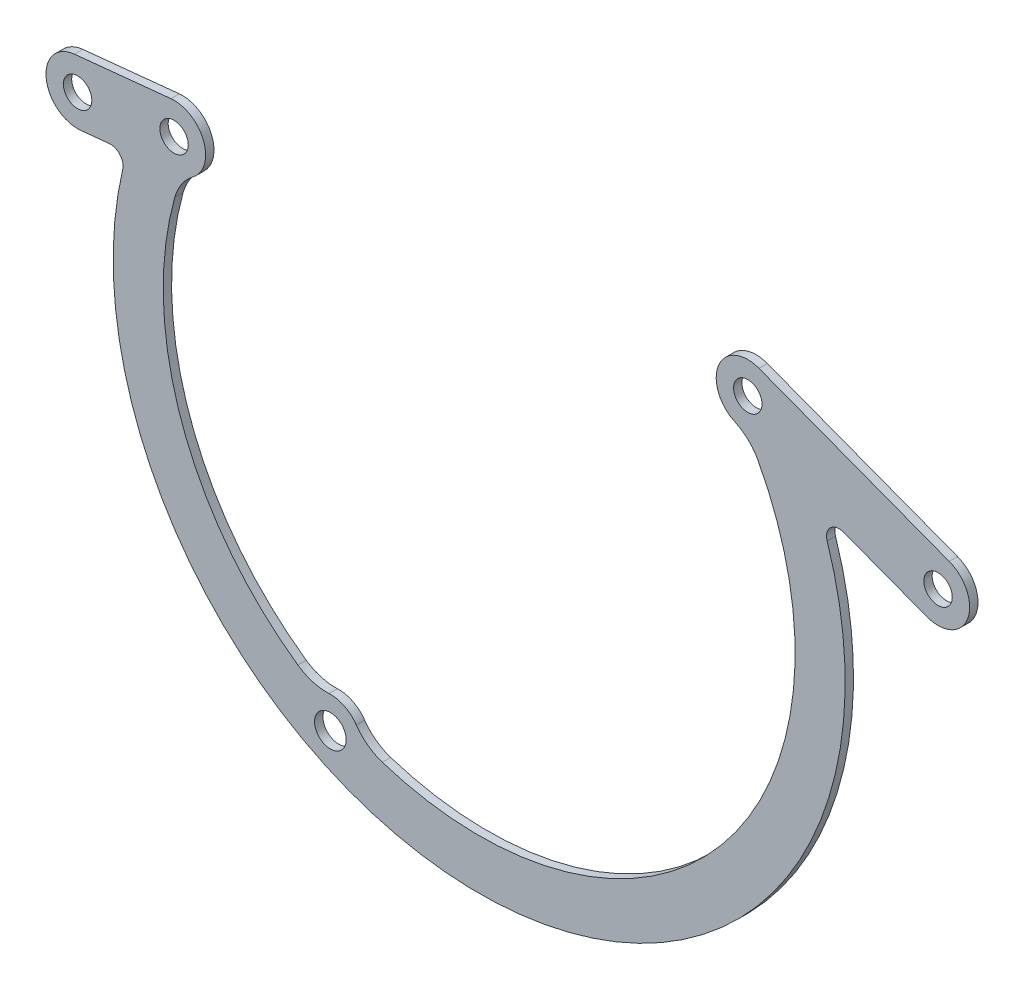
from build123d import *

# Parameters (mm, degrees)
SKETCH5_R           = 7.5
SKETCH5_R_2         = 3.375
BOSS_EXTRUDE2_DEPTH = 1.9812
FILLET1_R           = 3
SKETCH6_R           = 3.75
CUT_EXTRUDE1_DEPTH  = 242.952999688
CUT_EXTRUDE2_DEPTH  = 242.952999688


with BuildPart() as part:
    # Sketch5 → Boss-Extrude2 (new body)
    # profile 1 of 9: a face of its own
    with BuildSketch(Plane.XY):
        with BuildLine():
            ThreePointArc((-136.75, -101.25), (-140.299277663, -107.625091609), (-147.587811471, -107.966324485))
            ThreePointArc((-147.587811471, -107.966324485), (-63.162577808, -104.013717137), (-22.050251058, -30.169152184))
            ThreePointArc((-22.050251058, -30.169152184), (-23.68972279, -13.371253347), (-28.546258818, 2.792636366))
            Line((-28.546258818, 2.792636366), (-47.822285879, 10.093925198))
            ThreePointArc((-47.822285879, 10.093925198), (-49.689141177, 11.12533381), (-51.190181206, 12.640533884))
            ThreePointArc((-51.190181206, 12.640533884), (-40.676721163, -7.626931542), (-37.050251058, -30.169152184))
            ThreePointArc((-37.050251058, -30.169152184), (-71.064022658, -91.26353403), (-140.912188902, -94.53367533))
            ThreePointArc((-140.912188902, -94.53367533), (-137.874908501, -97.299277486), (-136.75, -101.25))
        make_face()
    # profile 2 of 9: a face of its own
    with BuildSketch(Plane.XY):
        with Locations((-144.25, -101.25)):
            Circle(SKETCH5_R)
        with Locations((-144.25, -101.25)):
            Circle(SKETCH5_R_2, mode=Mode.SUBTRACT)
    # profile 3 of 9: a face of its own
    with BuildSketch(Plane.XY):
        with BuildLine():
            Line((-180.602554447, -5.158750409), (-192.471353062, -6.352840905))
            ThreePointArc((-192.471353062, -6.352840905), (-188.392563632, -65.270668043), (-147.587811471, -107.966324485))
            ThreePointArc((-147.587811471, -107.966324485), (-150.966324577, -97.912188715), (-140.912188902, -94.53367533))
            ThreePointArc((-140.912188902, -94.53367533), (-176.587543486, -54.4127028), (-174.509671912, -0.764722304))
            ThreePointArc((-174.509671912, -0.764722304), (-176.96633364, -3.779541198), (-180.602554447, -5.158750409))
        make_face()
    # profile 4 of 9: a face of its own
    with BuildSketch(Plane.XY):
        with BuildLine():
            Line((-182.104087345, 9.765907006), (-186.293520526, 9.344418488))
            ThreePointArc((-186.293520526, 9.344418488), (-189.764347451, 1.646094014), (-192.471353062, -6.352840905))
            Line((-192.471353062, -6.352840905), (-180.602554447, -5.158750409))
            ThreePointArc((-180.602554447, -5.158750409), (-176.96633364, -3.779541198), (-174.509671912, -0.764722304))
            ThreePointArc((-174.509671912, -0.764722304), (-175.270201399, 6.690565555), (-182.104087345, 9.765907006))
        make_face()
        with Locations((-181.353320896, 2.303578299)):
            Circle(SKETCH5_R_2, mode=Mode.SUBTRACT)
    # profile 5 of 9: a face of its own
    with BuildSketch(Plane.XY):
        with BuildLine():
            Line((-186.293520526, 9.344418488), (-205.000766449, 7.462328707))
            ThreePointArc((-205.000766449, 7.462328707), (-211.712328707, -0.750766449), (-203.499233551, -7.462328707))
            Line((-203.499233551, -7.462328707), (-192.471353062, -6.352840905))
            ThreePointArc((-192.471353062, -6.352840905), (-189.764347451, 1.646094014), (-186.293520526, 9.344418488))
        make_face()
        with Locations((-204.25, 0)):
            Circle(SKETCH5_R_2, mode=Mode.SUBTRACT)
    # profile 6 of 9: a face of its own
    with BuildSketch(Plane.XY):
        with Locations((-45.165658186, 17.107649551)):
            Circle(SKETCH5_R)
        with Locations((-45.165658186, 17.107649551)):
            Circle(SKETCH5_R_2, mode=Mode.SUBTRACT)
    # profile 7 of 9: a face of its own
    with BuildSketch(Plane.XY):
        with BuildLine():
            ThreePointArc((-28.546258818, 2.792636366), (-33.258665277, 12.513713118), (-39.141134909, 21.574764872))
            ThreePointArc((-39.141134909, 21.574764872), (-38.044073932, 19.459890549), (-37.665658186, 17.107649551))
            ThreePointArc((-37.665658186, 17.107649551), (-40.903892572, 10.936154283), (-47.822285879, 10.093925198))
            Line((-47.822285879, 10.093925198), (-28.546258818, 2.792636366))
        make_face()
    # profile 8 of 9: a face of its own
    with BuildSketch(Plane.XY):
        with BuildLine():
            Line((2.656627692, 7.013724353), (-40.501797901, 23.361083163))
            ThreePointArc((-40.501797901, 23.361083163), (-39.815694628, 22.472320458), (-39.141134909, 21.574764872))
            ThreePointArc((-39.141134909, 21.574764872), (-33.258665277, 12.513713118), (-28.546258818, 2.792636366))
            Line((-28.546258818, 2.792636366), (-2.656627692, -7.013724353))
            ThreePointArc((-2.656627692, -7.013724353), (7.013724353, -2.656627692), (2.656627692, 7.013724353))
        make_face()
        Circle(SKETCH5_R_2, mode=Mode.SUBTRACT)
    # profile 9 of 9: a face of its own
    with BuildSketch(Plane.XY):
        with BuildLine():
            ThreePointArc((-39.141134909, 21.574764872), (-39.815694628, 22.472320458), (-40.501797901, 23.361083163))
            Line((-40.501797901, 23.361083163), (-42.509030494, 24.121373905))
            ThreePointArc((-42.509030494, 24.121373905), (-40.642175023, 23.089965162), (-39.141134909, 21.574764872))
        make_face()
    extrude(amount=BOSS_EXTRUDE2_DEPTH)

    # Fillet1
    fillet1_edges = [part.edges().sort_by_distance(p)[0] for p in [
        (-28.546258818, 2.792636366, 0.9906),
        (-192.471353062, -6.352840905, 0.9906),
    ]]
    fillet(fillet1_edges, radius=FILLET1_R)

    # Sketch6 → Cut-Extrude1 (cut, through all)
    with BuildSketch(Plane.XY.offset(1.9812)):
        with Locations((-144.25, -101.25)):
            Circle(SKETCH6_R)
    extrude(amount=-CUT_EXTRUDE1_DEPTH, mode=Mode.SUBTRACT)

    # Sketch7 → Cut-Extrude2 (cut, through all)
    with BuildSketch(Plane.XY.offset(1.9812)):
        with BuildLine():
            ThreePointArc((-140.912189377, -94.533675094), (-139.34465666, -95.576587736), (-138.086254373, -96.977033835))
            ThreePointArc((-138.086254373, -96.977033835), (-135.371169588, -99.779878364), (-131.900317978, -101.563361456))
            ThreePointArc((-131.900317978, -101.563361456), (-51.416755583, -78.312749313), (-42.684981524, 5.005621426))
            ThreePointArc((-42.684981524, 5.005621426), (-45.051151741, 8.108662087), (-48.287858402, 10.288421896))
            ThreePointArc((-48.287858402, 10.288421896), (-49.887812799, 11.280878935), (-51.190181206, 12.640533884))
            ThreePointArc((-51.190181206, 12.640533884), (-53.81315101, -76.306582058), (-140.912189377, -94.533675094))
        make_face()
        with BuildLine():
            ThreePointArc((-144.566251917, -93.756670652), (-142.690067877, -93.914019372), (-140.912189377, -94.533675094))
            ThreePointArc((-140.912189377, -94.533675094), (-176.587543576, -54.41270255), (-174.509671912, -0.764722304))
            ThreePointArc((-174.509671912, -0.764722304), (-175.489474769, -2.372457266), (-176.838812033, -3.685512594))
            ThreePointArc((-176.838812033, -3.685512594), (-179.531558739, -6.509824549), (-181.175718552, -10.048801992))
            ThreePointArc((-181.175718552, -10.048801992), (-179.529676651, -55.466870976), (-151.957453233, -91.595570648))
            ThreePointArc((-151.957453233, -91.595570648), (-148.439913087, -93.285107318), (-144.566251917, -93.756670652))
        make_face()
    extrude(amount=-CUT_EXTRUDE2_DEPTH, mode=Mode.SUBTRACT)


solid = part.part
